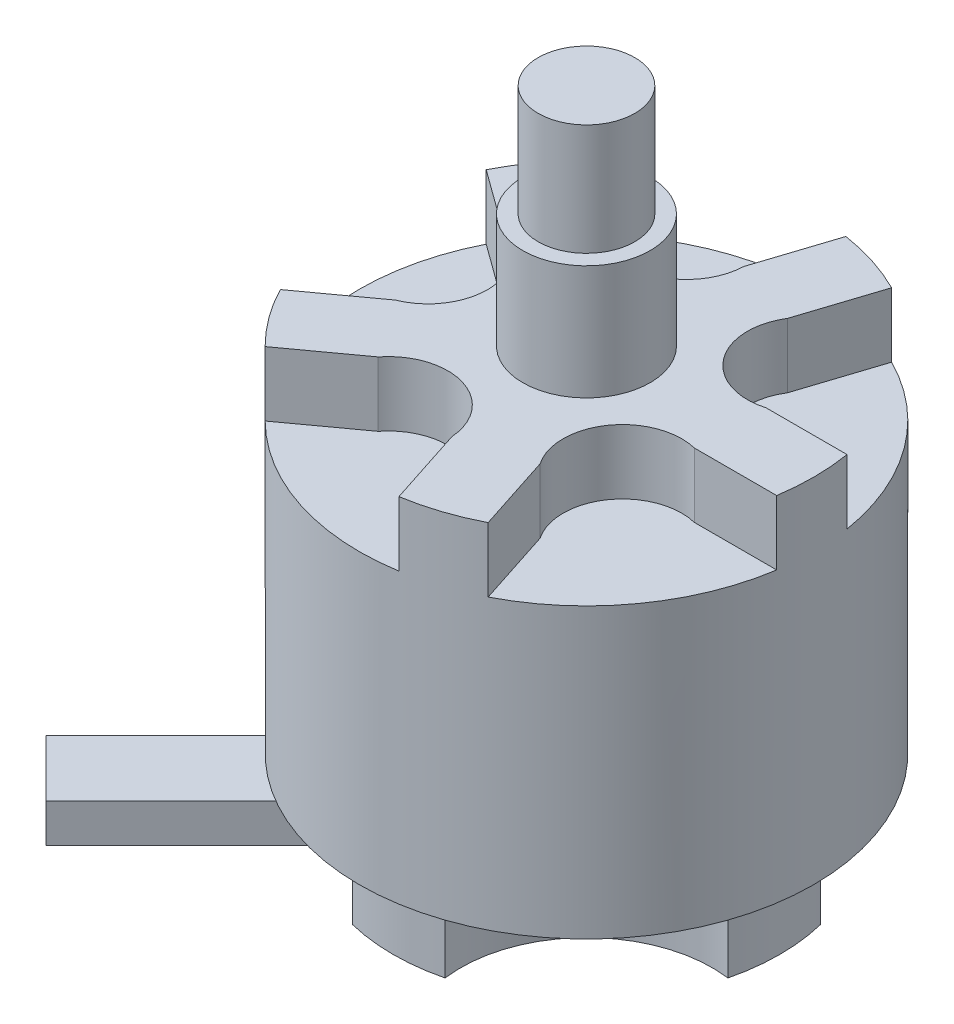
from build123d import *

# Parameters (mm, degrees)
CHAMFER_1_SIZE         = 2
HOLE_WIZARD_M3_2_D     = 2.5
HOLE_WIZARD_M3_2_DEPTH = 3.8
HOLE_WIZARD_M3_2_TIP   = 0.751075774
CUT_EXTRUDE_START      = -46
SKETCH_7_R             = 14.396754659
SKETCH_7_R_2           = 14.1
CUT_EXTRUDE_1_DEPTH    = 46
SKETCH_8_R             = 17.810818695
SKETCH_8_R_2           = 12
CUT_EXTRUDE_2_DEPTH    = 6.3
SKETCH_9_R             = 12.396754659
EXTRUDE_1_DEPTH        = 0.7
SKETCH_10_R            = 3.95
EXTRUDE_2_DEPTH        = 13.7
EXTRUDE_START          = 0.7
SKETCH_11_R            = 3.95
EXTRUDE_3_DEPTH        = 0.7
SKETCH_12_R            = 7.407678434
SKETCH_12_R_2          = 3
CUT_EXTRUDE_3_DEPTH    = 6.9
SKETCH_13_R            = 4.570314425
CUT_EXTRUDE_4_DEPTH    = 6.9
CUT_EXTRUDE_5_DEPTH    = 6.3
SKETCH_18_R            = 4.82
CUT_EXTRUDE_7_DEPTH    = 5
EXTRUDE_4_DEPTH        = 1
SKETCH_21_W            = 5
SKETCH_21_H            = 2.4
EXTRUDE_5_DEPTH        = 18
SKETCH_22_R            = 1.457437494
CUT_EXTRUDE_8_DEPTH    = 1.769568
CUT_EXTRUDE_9_DEPTH    = 6.9
SKETCH_24_R            = 14.1
EXTRUDE_7_DEPTH        = 6.9
CUT_EXTRUDE_START_2    = -4.5
CUT_EXTRUDE_10_DEPTH   = 4.5
SKETCH_27_R            = 14.1
EXTRUDE_8_DEPTH        = 1.1
EXTRUDE_START_2        = 1.5
SKETCH_28_R            = 14.1
EXTRUDE_9_DEPTH        = 1.5
CUT_EXTRUDE_START_3    = -0.6
CUT_EXTRUDE_12_DEPTH   = 0.6


with BuildPart() as part:
    # Sketch 1 → Revolve 1 (revolve)
    with BuildSketch(Plane.XY, mode=Mode.PRIVATE) as revolve_1_sk:
        Polygon((0, 40), (3, 40), (3, 27), (4, 26), (12.396754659, 26), (14.396754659, 22), (14.396754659, 0), (0, 0), align=None)
    revolve(revolve_1_sk.sketch.rotate(Axis((0, 0, 0), (0, 1, 0)), 90), axis=Axis((0, 0, 0), (0, 1, 0)))

    # Chamfer 1
    chamfer_1_edges = [part.edges().sort_by_distance(p)[0] for p in [
        (0, 0, 14.396754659),
    ]]
    chamfer(chamfer_1_edges, length=CHAMFER_1_SIZE)

    # Hole Wizard M3 _2
    with Locations(Plane(origin=(0, 0, 0), x_dir=(-1, 0, 0), z_dir=(0, -1, 0))):
        with Locations((0, -9.5), (-8, 0), (0, 9.5), (8, 0)):
            Hole(HOLE_WIZARD_M3_2_D / 2, depth=HOLE_WIZARD_M3_2_DEPTH)
            with Locations((0, 0, -(HOLE_WIZARD_M3_2_DEPTH + HOLE_WIZARD_M3_2_TIP / 2))):  # 118° drill point
                Cone(0, HOLE_WIZARD_M3_2_D / 2, HOLE_WIZARD_M3_2_TIP, mode=Mode.SUBTRACT)

    # Sketch 7 → Cut-Extrude 1 (cut)
    with BuildSketch(Plane(origin=(0, 26, 0), x_dir=(1, 0, 0), z_dir=(0, 1, 0)).offset(CUT_EXTRUDE_START)):
        Circle(SKETCH_7_R)
        with Locations(Location((0, 0, 0), (0, 0, 270))):
            Circle(SKETCH_7_R_2, mode=Mode.SUBTRACT)
    extrude(amount=CUT_EXTRUDE_1_DEPTH, mode=Mode.SUBTRACT)

    # Sketch 8 → Cut-Extrude 2 (cut)
    with BuildSketch(Plane.XZ):
        Circle(SKETCH_8_R)
        with Locations(Location((0, 0, 0), (0, 0, 270))):
            Circle(SKETCH_8_R_2, mode=Mode.SUBTRACT)
    extrude(amount=-CUT_EXTRUDE_2_DEPTH, mode=Mode.SUBTRACT)

    # Sketch 9 → Extrude 1 (add)
    with BuildSketch(Plane(origin=(0, 26, 0), x_dir=(1, 0, 0), z_dir=(0, 1, 0))):
        with Locations(Location((0, 0, 0), (0, 0, 270))):
            Circle(SKETCH_9_R)
    extrude(amount=EXTRUDE_1_DEPTH)

    # Sketch 10 → Extrude 2 (add)
    with BuildSketch(Plane(origin=(0, 40, 0), x_dir=(1, 0, 0), z_dir=(0, 1, 0))):
        with Locations(Location((0, 0, 0), (0, 0, 270))):
            Circle(SKETCH_10_R)
    extrude(amount=-EXTRUDE_2_DEPTH)

    # Sketch 11 → Extrude 3 (add)
    with BuildSketch(Plane(origin=(0, 40, 0), x_dir=(1, 0, 0), z_dir=(0, 1, 0)).offset(EXTRUDE_START)):
        with Locations(Location((0, 0, 0), (0, 0, 270))):
            Circle(SKETCH_11_R)
    extrude(amount=-EXTRUDE_3_DEPTH)

    # Sketch 12 → Cut-Extrude 3 (cut)
    with BuildSketch(Plane(origin=(0, 40.7, 0), x_dir=(1, 0, 0), z_dir=(0, 1, 0))):
        Circle(SKETCH_12_R)
        with Locations(Location((0, 0, 0), (0, 0, 270))):
            Circle(SKETCH_12_R_2, mode=Mode.SUBTRACT)
    extrude(amount=-CUT_EXTRUDE_3_DEPTH, mode=Mode.SUBTRACT)

    # Sketch 13 → Cut-Extrude 4 (cut)
    with BuildSketch(Plane(origin=(0, 26.7, 0), x_dir=(1, 0, 0), z_dir=(0, 1, 0))):
        with Locations((5.967563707, 10.865896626)):
            Circle(SKETCH_13_R)
        with Locations((12.178160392, -2.317743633)):
            Circle(SKETCH_13_R)
        with Locations((1.558953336, -12.298340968)):
            Circle(SKETCH_13_R)
        with Locations((-11.214674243, -5.28304909)):
            Circle(SKETCH_13_R)
        with Locations((-8.490003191, 9.033237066)):
            Circle(SKETCH_13_R)
    extrude(amount=-CUT_EXTRUDE_4_DEPTH, mode=Mode.SUBTRACT)

    # Sketch 14 → Cut-Extrude 5 (cut)
    with BuildSketch(Plane.XZ):
        with BuildLine():
            ThreePointArc((11.650086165, 2.876715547), (8.485281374, 8.485281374), (2.876715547, 11.650086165))
            ThreePointArc((2.876715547, 11.650086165), (5.091168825, 5.091168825), (11.650086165, 2.876715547))
        make_face()
        with BuildLine():
            ThreePointArc((-11.650086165, 2.876715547), (-5.091168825, 5.091168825), (-2.876715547, 11.650086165))
            ThreePointArc((-2.876715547, 11.650086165), (-8.485281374, 8.485281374), (-11.650086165, 2.876715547))
        make_face()
        with BuildLine():
            ThreePointArc((11.650086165, -2.876715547), (5.091168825, -5.091168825), (2.876715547, -11.650086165))
            ThreePointArc((2.876715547, -11.650086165), (8.485281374, -8.485281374), (11.650086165, -2.876715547))
        make_face()
        with BuildLine():
            ThreePointArc((-2.876715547, -11.650086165), (-5.091168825, -5.091168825), (-11.650086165, -2.876715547))
            ThreePointArc((-11.650086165, -2.876715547), (-8.485281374, -8.485281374), (-2.876715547, -11.650086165))
        make_face()
    extrude(amount=-CUT_EXTRUDE_5_DEPTH, mode=Mode.SUBTRACT)

    # Sketch 15 → Cut-Revolve 2 (revolve, cut)
    with BuildSketch(Plane.XY, mode=Mode.PRIVATE) as cut_revolve_2_sk:
        Polygon((7.228343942, 6.3), (7.228343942, 4.8), (16.286910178, 2.922961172), (16.286910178, 6.3), align=None)
    revolve(cut_revolve_2_sk.sketch.rotate(Axis((0, 0, 0), (0, 1, 0)), 258.765062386), axis=Axis((0, 0, 0), (0, 1, 0)), mode=Mode.SUBTRACT)

    # Sketch 18 → Cut-Extrude 7 (cut)
    with BuildSketch(Plane(origin=(0, 0, 0), x_dir=(-1, 0, 0), z_dir=(0, -1, 0))):
        with Locations(Location((0, 0, 0), (0, 0, 90))):
            Circle(SKETCH_18_R)
    extrude(amount=-CUT_EXTRUDE_7_DEPTH, mode=Mode.SUBTRACT)

    # Sketch 20 → Extrude 4 (add)
    with BuildSketch(Plane.XZ.offset(-5)):
        Polygon((0, 1), (-1, 0), (0, 0), align=None)
    extrude(amount=EXTRUDE_4_DEPTH)

    # Sketch 21 → Extrude 5 (add)
    with BuildSketch(Plane(origin=(-4.035533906, 0, 4.035533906), x_dir=(0.7071067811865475, 0, 0.7071067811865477), z_dir=(-0.7071067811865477, 0, 0.7071067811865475))):
        with Locations((-1.105130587, 2.03043211)):
            Rectangle(SKETCH_21_W, SKETCH_21_H)
    extrude(amount=EXTRUDE_5_DEPTH)

    # Sketch 22 → Cut-Extrude 8 (cut)
    with BuildSketch(Plane.XZ.offset(-5)):
        Circle(SKETCH_22_R)
    extrude(amount=CUT_EXTRUDE_8_DEPTH, mode=Mode.SUBTRACT)

    # Sketch 23 → Cut-Extrude 9 (cut)
    with BuildSketch(Plane(origin=(0, 26.7, 0), x_dir=(1, 0, 0), z_dir=(0, 1, 0))):
        Polygon((-16.212513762, 0.795173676), (-7.596317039, -0.844658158), (-7.08015768, -3.335346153), (-15.052026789, -3.768482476), align=None)
        Polygon((-6.754980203, 3.57599251), (-15.371176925, 5.215824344), (-13.328546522, 9.851520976), (-5.359991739, 5.702951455), align=None)
    extrude(amount=-CUT_EXTRUDE_9_DEPTH, mode=Mode.SUBTRACT)

    # Sketch 24 → Extrude 7 (add)
    with BuildSketch(Plane(origin=(0, 19.8, 0), x_dir=(1, 0, 0), z_dir=(0, 1, 0))):
        with Locations(Location((0, 0, 0), (0, 0, 270))):
            Circle(SKETCH_24_R)
    extrude(amount=EXTRUDE_7_DEPTH)

    # Sketch 26 → Cut-Extrude 10 (cut)
    with BuildSketch(Plane(origin=(0, 26.7, 0), x_dir=(1, 0, 0), z_dir=(0, 1, 0)).offset(CUT_EXTRUDE_START_2)):
        with BuildLine():
            Line((8.823563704, -2.134523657), (13.937496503, -2.134523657))
            ThreePointArc((13.937496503, -2.134523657), (11.441397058, -8.240414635), (6.441183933, -12.542772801))
            Line((6.441183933, -12.542772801), (4.889551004, -7.76733768))
            ThreePointArc((4.889551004, -7.76733768), (4.920321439, -3.598644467), (8.823563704, -2.134523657))
        make_face()
        with BuildLine():
            Line((8.89813147, 2.25), (13.919321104, 2.25))
            ThreePointArc((13.919321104, 2.25), (11.372686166, 8.334987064), (6.336975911, 12.595742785))
            Line((6.336975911, 12.595742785), (4.756683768, 7.732103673))
            ThreePointArc((4.756683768, 7.732103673), (4.942977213, 3.56746147), (8.89813147, 2.25))
        make_face()
        with BuildLine():
            Line((0.696578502, -9.051311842), (2.276870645, -13.914950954))
            ThreePointArc((2.276870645, -13.914950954), (-4.301513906, -13.42784339), (-9.938450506, -10.001859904))
            Line((-9.938450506, -10.001859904), (-5.87622276, -7.050478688))
            ThreePointArc((-5.87622276, -7.050478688), (-1.902051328, -5.791546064), (0.696578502, -9.051311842))
        make_face()
        with BuildLine():
            Line((-8.393054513, -3.459494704), (-12.530313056, -6.465388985))
            ThreePointArc((-12.530313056, -6.465388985), (-14.099878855, -0.058448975), (-12.583484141, 6.36128343))
            Line((-12.583484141, 6.36128343), (-8.521256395, 3.409902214))
            ThreePointArc((-8.521256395, 3.409902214), (-6.095853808, 0.019272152), (-8.393054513, -3.459494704))
        make_face()
        with BuildLine():
            Line((-5.883771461, 6.913226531), (-10.021030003, 9.919120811))
            ThreePointArc((-10.021030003, 9.919120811), (-4.412690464, 13.391719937), (2.16142961, 13.933349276))
            Line((2.16142961, 13.933349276), (0.609796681, 9.157914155))
            ThreePointArc((0.609796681, 9.157914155), (-1.865393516, 5.803456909), (-5.883771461, 6.913226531))
        make_face()
    extrude(amount=CUT_EXTRUDE_10_DEPTH, mode=Mode.SUBTRACT)

    # Sketch 27 → Extrude 8 (add)
    with BuildSketch(Plane(origin=(0, 22.2, 0), x_dir=(1, 0, 0), z_dir=(0, 1, 0))):
        with Locations(Location((0, 0, 0), (0, 0, 279.292822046))):
            Circle(SKETCH_27_R)
    extrude(amount=EXTRUDE_8_DEPTH)

    # Sketch 28 → Extrude 9 (add)
    with BuildSketch(Plane.XZ.offset(-6.3).offset(EXTRUDE_START_2)):
        with Locations(Location((0, 0, 0), (0, 0, 80.707177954))):
            Circle(SKETCH_28_R)
    extrude(amount=-EXTRUDE_9_DEPTH)

    # Sketch 29 → Cut-Extrude 12 (cut)
    with BuildSketch(Plane(origin=(0, 23.3, 0), x_dir=(1, 0, 0), z_dir=(0, 1, 0)).offset(CUT_EXTRUDE_START_3)):
        with BuildLine():
            Line((8.89813147, 2.25), (13.919321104, 2.25))
            ThreePointArc((13.919321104, 2.25), (11.372686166, 8.334987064), (6.336975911, 12.595742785))
            Line((6.336975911, 12.595742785), (4.756683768, 7.732103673))
            ThreePointArc((4.756683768, 7.732103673), (4.942977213, 3.56746147), (8.89813147, 2.25))
        make_face()
        with BuildLine():
            Line((4.889551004, -7.76733768), (6.441183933, -12.542772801))
            ThreePointArc((6.441183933, -12.542772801), (11.441397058, -8.240414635), (13.937496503, -2.134523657))
            Line((13.937496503, -2.134523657), (8.823563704, -2.134523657))
            ThreePointArc((8.823563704, -2.134523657), (4.920321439, -3.598644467), (4.889551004, -7.76733768))
        make_face()
        with BuildLine():
            Line((-5.87622276, -7.050478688), (-9.938450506, -10.001859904))
            ThreePointArc((-9.938450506, -10.001859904), (-4.301513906, -13.42784339), (2.276870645, -13.914950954))
            Line((2.276870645, -13.914950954), (0.696578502, -9.051311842))
            ThreePointArc((0.696578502, -9.051311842), (-1.902051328, -5.791546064), (-5.87622276, -7.050478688))
        make_face()
        with BuildLine():
            Line((-8.521256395, 3.409902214), (-12.583484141, 6.36128343))
            ThreePointArc((-12.583484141, 6.36128343), (-14.099878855, -0.058448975), (-12.530313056, -6.465388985))
            Line((-12.530313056, -6.465388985), (-8.393054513, -3.459494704))
            ThreePointArc((-8.393054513, -3.459494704), (-6.095853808, 0.019272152), (-8.521256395, 3.409902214))
        make_face()
        with BuildLine():
            Line((0.609796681, 9.157914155), (2.16142961, 13.933349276))
            ThreePointArc((2.16142961, 13.933349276), (-4.412690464, 13.391719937), (-10.021030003, 9.919120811))
            Line((-10.021030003, 9.919120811), (-5.883771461, 6.913226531))
            ThreePointArc((-5.883771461, 6.913226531), (-1.865393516, 5.803456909), (0.609796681, 9.157914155))
        make_face()
    extrude(amount=CUT_EXTRUDE_12_DEPTH, mode=Mode.SUBTRACT)


solid = part.part
